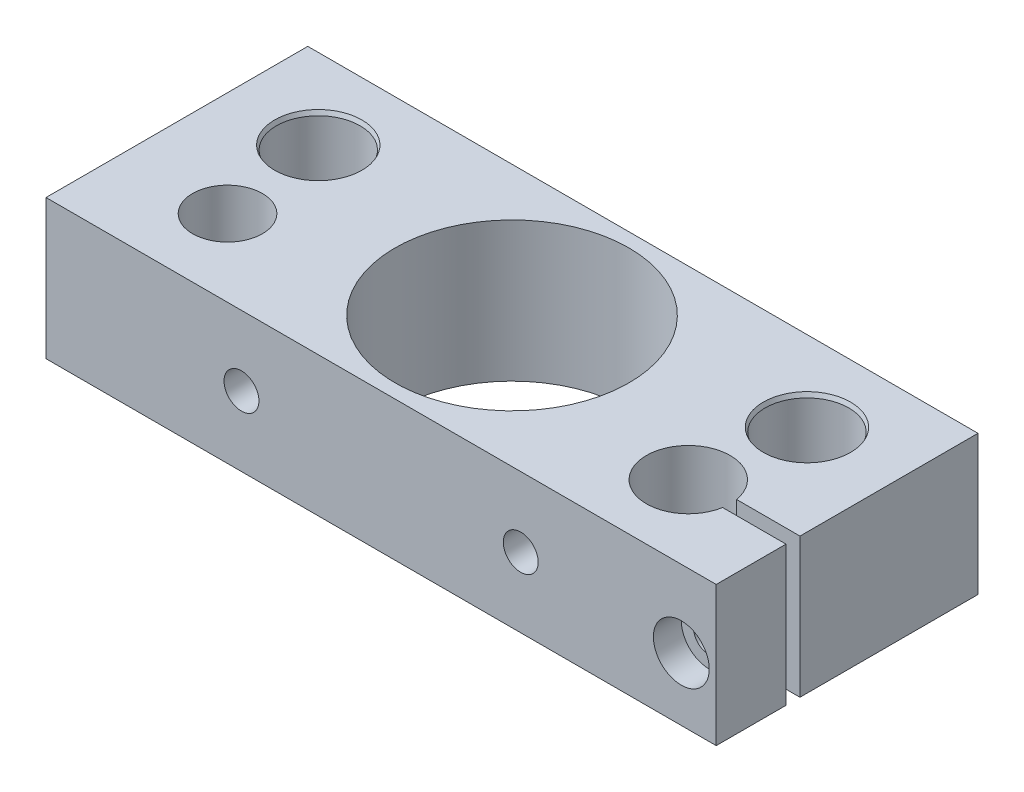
ISO-10303-21;
HEADER;
FILE_DESCRIPTION(('STEP AP214'),'2;1');
FILE_NAME('part.step','',(''),(''),'','','');
FILE_SCHEMA(('AUTOMOTIVE_DESIGN { 1 0 10303 214 1 1 1 1 }'));
ENDSEC;
DATA;
#1=APPLICATION_CONTEXT('core data for automotive mechanical design processes');
#2=APPLICATION_PROTOCOL_DEFINITION('international standard','automotive_design',2000,#1);
#3=PRODUCT_CONTEXT('',#1,'mechanical');
#4=PRODUCT('Part','Part','',(#3));
#5=PRODUCT_RELATED_PRODUCT_CATEGORY('part','',(#4));
#6=PRODUCT_DEFINITION_FORMATION('','',#4);
#7=PRODUCT_DEFINITION_CONTEXT('part definition',#1,'design');
#8=PRODUCT_DEFINITION('design','',#6,#7);
#9=PRODUCT_DEFINITION_SHAPE('','',#8);
#10=(LENGTH_UNIT() NAMED_UNIT(*) SI_UNIT(.MILLI.,.METRE.));
#11=(NAMED_UNIT(*) PLANE_ANGLE_UNIT() SI_UNIT($,.RADIAN.));
#12=(NAMED_UNIT(*) SI_UNIT($,.STERADIAN.) SOLID_ANGLE_UNIT());
#13=UNCERTAINTY_MEASURE_WITH_UNIT(LENGTH_MEASURE(1.E-05),#10,'distance_accuracy_value','');
#14=(GEOMETRIC_REPRESENTATION_CONTEXT(3) GLOBAL_UNCERTAINTY_ASSIGNED_CONTEXT((#13)) GLOBAL_UNIT_ASSIGNED_CONTEXT((#10,
#11,#12)) REPRESENTATION_CONTEXT('',''));
#15=CARTESIAN_POINT('',(0.,0.,0.));
#16=DIRECTION('',(0.,0.,1.));
#17=DIRECTION('',(1.,0.,0.));
#18=AXIS2_PLACEMENT_3D('',#15,#16,#17);
#19=CARTESIAN_POINT('',(96.,20.,0.));
#20=DIRECTION('',(-1.,0.,0.));
#21=DIRECTION('',(0.,0.,1.));
#22=AXIS2_PLACEMENT_3D('',#19,#20,#21);
#23=PLANE('',#22);
#24=DIRECTION('',(0.,0.,-1.));
#25=VECTOR('',#24,1.);
#26=CARTESIAN_POINT('',(96.,0.,0.));
#27=LINE('',#26,#25);
#28=CARTESIAN_POINT('',(96.,0.,0.));
#29=VERTEX_POINT('',#28);
#30=CARTESIAN_POINT('',(96.,0.,-10.));
#31=VERTEX_POINT('',#30);
#32=EDGE_CURVE('E9334',#29,#31,#27,.T.);
#33=ORIENTED_EDGE('',*,*,#32,.T.);
#34=DIRECTION('',(0.,-1.,0.));
#35=VECTOR('',#34,1.);
#36=CARTESIAN_POINT('',(96.,-0.999999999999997,-10.));
#37=LINE('',#36,#35);
#38=CARTESIAN_POINT('',(96.,20.,-10.));
#39=VERTEX_POINT('',#38);
#40=EDGE_CURVE('E9271',#39,#31,#37,.T.);
#41=ORIENTED_EDGE('',*,*,#40,.F.);
#42=DIRECTION('',(0.,0.,-1.));
#43=VECTOR('',#42,1.);
#44=CARTESIAN_POINT('',(96.,20.,0.));
#45=LINE('',#44,#43);
#46=CARTESIAN_POINT('',(96.,20.,0.));
#47=VERTEX_POINT('',#46);
#48=EDGE_CURVE('E9345',#47,#39,#45,.T.);
#49=ORIENTED_EDGE('',*,*,#48,.F.);
#50=DIRECTION('',(0.,-1.,0.));
#51=VECTOR('',#50,1.);
#52=CARTESIAN_POINT('',(96.,20.,0.));
#53=LINE('',#52,#51);
#54=EDGE_CURVE('E9356',#47,#29,#53,.T.);
#55=ORIENTED_EDGE('',*,*,#54,.T.);
#56=EDGE_LOOP('',(#33,#41,#49,#55));
#57=FACE_BOUND('',#56,.T.);
#58=ADVANCED_FACE('F9174',(#57),#23,.F.);
#59=CARTESIAN_POINT('',(0.,20.,0.));
#60=DIRECTION('',(1.,0.,0.));
#61=DIRECTION('',(0.,0.,-1.));
#62=AXIS2_PLACEMENT_3D('',#59,#60,#61);
#63=PLANE('',#62);
#64=DIRECTION('',(0.,0.,1.));
#65=VECTOR('',#64,1.);
#66=CARTESIAN_POINT('',(0.,0.,0.));
#67=LINE('',#66,#65);
#68=CARTESIAN_POINT('',(0.,0.,-37.5));
#69=VERTEX_POINT('',#68);
#70=CARTESIAN_POINT('',(0.,0.,0.));
#71=VERTEX_POINT('',#70);
#72=EDGE_CURVE('E9328',#69,#71,#67,.T.);
#73=ORIENTED_EDGE('',*,*,#72,.T.);
#74=DIRECTION('',(0.,-1.,0.));
#75=VECTOR('',#74,1.);
#76=CARTESIAN_POINT('',(0.,20.,0.));
#77=LINE('',#76,#75);
#78=CARTESIAN_POINT('',(0.,20.,0.));
#79=VERTEX_POINT('',#78);
#80=EDGE_CURVE('E9359',#79,#71,#77,.T.);
#81=ORIENTED_EDGE('',*,*,#80,.F.);
#82=DIRECTION('',(0.,0.,1.));
#83=VECTOR('',#82,1.);
#84=CARTESIAN_POINT('',(0.,20.,0.));
#85=LINE('',#84,#83);
#86=CARTESIAN_POINT('',(0.,20.,-37.5));
#87=VERTEX_POINT('',#86);
#88=EDGE_CURVE('E9339',#87,#79,#85,.T.);
#89=ORIENTED_EDGE('',*,*,#88,.F.);
#90=DIRECTION('',(0.,-1.,0.));
#91=VECTOR('',#90,1.);
#92=CARTESIAN_POINT('',(0.,20.,-37.5));
#93=LINE('',#92,#91);
#94=EDGE_CURVE('E9350',#87,#69,#93,.T.);
#95=ORIENTED_EDGE('',*,*,#94,.T.);
#96=EDGE_LOOP('',(#73,#81,#89,#95));
#97=FACE_BOUND('',#96,.T.);
#98=ADVANCED_FACE('F9176',(#97),#63,.F.);
#99=CARTESIAN_POINT('',(0.,20.,0.));
#100=DIRECTION('',(0.,0.,-1.));
#101=DIRECTION('',(-1.,0.,0.));
#102=AXIS2_PLACEMENT_3D('',#99,#100,#101);
#103=PLANE('',#102);
#104=CARTESIAN_POINT('',(91.,9.,0.));
#105=DIRECTION('',(0.,0.,1.));
#106=DIRECTION('',(1.,0.,0.));
#107=AXIS2_PLACEMENT_3D('',#104,#105,#106);
#108=CIRCLE('',#107,4.);
#109=CARTESIAN_POINT('',(95.,9.,0.));
#110=VERTEX_POINT('',#109);
#111=EDGE_CURVE('E9266',#110,#110,#108,.T.);
#112=ORIENTED_EDGE('',*,*,#111,.F.);
#113=EDGE_LOOP('',(#112));
#114=FACE_BOUND('',#113,.T.);
#115=CARTESIAN_POINT('',(68.,10.,0.));
#116=DIRECTION('',(0.,0.,1.));
#117=DIRECTION('',(1.,0.,0.));
#118=AXIS2_PLACEMENT_3D('',#115,#116,#117);
#119=CIRCLE('',#118,2.49999999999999);
#120=CARTESIAN_POINT('',(70.5,10.,0.));
#121=VERTEX_POINT('',#120);
#122=EDGE_CURVE('E9295',#121,#121,#119,.T.);
#123=ORIENTED_EDGE('',*,*,#122,.F.);
#124=EDGE_LOOP('',(#123));
#125=FACE_BOUND('',#124,.T.);
#126=CARTESIAN_POINT('',(28.,10.,0.));
#127=DIRECTION('',(0.,0.,1.));
#128=DIRECTION('',(1.,0.,0.));
#129=AXIS2_PLACEMENT_3D('',#126,#127,#128);
#130=CIRCLE('',#129,2.49999999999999);
#131=CARTESIAN_POINT('',(30.5,10.,0.));
#132=VERTEX_POINT('',#131);
#133=EDGE_CURVE('E9301',#132,#132,#130,.T.);
#134=ORIENTED_EDGE('',*,*,#133,.F.);
#135=EDGE_LOOP('',(#134));
#136=FACE_BOUND('',#135,.T.);
#137=DIRECTION('',(1.,0.,0.));
#138=VECTOR('',#137,1.);
#139=CARTESIAN_POINT('',(0.,0.,0.));
#140=LINE('',#139,#138);
#141=EDGE_CURVE('E9331',#71,#29,#140,.T.);
#142=ORIENTED_EDGE('',*,*,#141,.T.);
#143=ORIENTED_EDGE('',*,*,#54,.F.);
#144=DIRECTION('',(1.,0.,0.));
#145=VECTOR('',#144,1.);
#146=CARTESIAN_POINT('',(0.,20.,0.));
#147=LINE('',#146,#145);
#148=EDGE_CURVE('E9342',#79,#47,#147,.T.);
#149=ORIENTED_EDGE('',*,*,#148,.F.);
#150=ORIENTED_EDGE('',*,*,#80,.T.);
#151=EDGE_LOOP('',(#142,#143,#149,#150));
#152=FACE_BOUND('',#151,.T.);
#153=ADVANCED_FACE('F9396',(#114,#125,#136,#152),#103,.F.);
#154=CARTESIAN_POINT('',(96.,20.,-12.));
#155=VERTEX_POINT('',#154);
#156=CARTESIAN_POINT('',(96.,20.,-37.5));
#157=VERTEX_POINT('',#156);
#158=EDGE_CURVE('E9344',#155,#157,#45,.T.);
#159=ORIENTED_EDGE('',*,*,#158,.F.);
#160=DIRECTION('',(0.,1.,0.));
#161=VECTOR('',#160,1.);
#162=CARTESIAN_POINT('',(96.,-0.999999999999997,-12.));
#163=LINE('',#162,#161);
#164=CARTESIAN_POINT('',(96.,0.,-12.));
#165=VERTEX_POINT('',#164);
#166=EDGE_CURVE('E9269',#165,#155,#163,.T.);
#167=ORIENTED_EDGE('',*,*,#166,.F.);
#168=CARTESIAN_POINT('',(96.,0.,-37.5));
#169=VERTEX_POINT('',#168);
#170=EDGE_CURVE('E9333',#165,#169,#27,.T.);
#171=ORIENTED_EDGE('',*,*,#170,.T.);
#172=DIRECTION('',(0.,-1.,0.));
#173=VECTOR('',#172,1.);
#174=CARTESIAN_POINT('',(96.,20.,-37.5));
#175=LINE('',#174,#173);
#176=EDGE_CURVE('E9353',#157,#169,#175,.T.);
#177=ORIENTED_EDGE('',*,*,#176,.F.);
#178=EDGE_LOOP('',(#159,#167,#171,#177));
#179=FACE_BOUND('',#178,.T.);
#180=ADVANCED_FACE('F9386',(#179),#23,.F.);
#181=CARTESIAN_POINT('',(0.,20.,-37.5));
#182=DIRECTION('',(0.,0.,1.));
#183=DIRECTION('',(1.,0.,0.));
#184=AXIS2_PLACEMENT_3D('',#181,#182,#183);
#185=PLANE('',#184);
#186=CARTESIAN_POINT('',(68.,10.,-37.5));
#187=DIRECTION('',(0.,0.,1.));
#188=DIRECTION('',(1.,0.,0.));
#189=AXIS2_PLACEMENT_3D('',#186,#187,#188);
#190=CIRCLE('',#189,2.49999999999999);
#191=CARTESIAN_POINT('',(70.5,10.,-37.5));
#192=VERTEX_POINT('',#191);
#193=EDGE_CURVE('E9292',#192,#192,#190,.T.);
#194=ORIENTED_EDGE('',*,*,#193,.T.);
#195=EDGE_LOOP('',(#194));
#196=FACE_BOUND('',#195,.T.);
#197=CARTESIAN_POINT('',(28.,10.,-37.5));
#198=DIRECTION('',(0.,0.,1.));
#199=DIRECTION('',(1.,0.,0.));
#200=AXIS2_PLACEMENT_3D('',#197,#198,#199);
#201=CIRCLE('',#200,2.49999999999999);
#202=CARTESIAN_POINT('',(30.5,10.,-37.5));
#203=VERTEX_POINT('',#202);
#204=EDGE_CURVE('E9298',#203,#203,#201,.T.);
#205=ORIENTED_EDGE('',*,*,#204,.T.);
#206=EDGE_LOOP('',(#205));
#207=FACE_BOUND('',#206,.T.);
#208=DIRECTION('',(-1.,0.,0.));
#209=VECTOR('',#208,1.);
#210=CARTESIAN_POINT('',(0.,0.,-37.5));
#211=LINE('',#210,#209);
#212=EDGE_CURVE('E9337',#169,#69,#211,.T.);
#213=ORIENTED_EDGE('',*,*,#212,.T.);
#214=ORIENTED_EDGE('',*,*,#94,.F.);
#215=DIRECTION('',(-1.,0.,0.));
#216=VECTOR('',#215,1.);
#217=CARTESIAN_POINT('',(0.,20.,-37.5));
#218=LINE('',#217,#216);
#219=EDGE_CURVE('E9348',#157,#87,#218,.T.);
#220=ORIENTED_EDGE('',*,*,#219,.F.);
#221=ORIENTED_EDGE('',*,*,#176,.T.);
#222=EDGE_LOOP('',(#213,#214,#220,#221));
#223=FACE_BOUND('',#222,.T.);
#224=ADVANCED_FACE('F9393',(#196,#207,#223),#185,.F.);
#225=CARTESIAN_POINT('',(0.,20.,-37.5));
#226=DIRECTION('',(0.,-1.,0.));
#227=DIRECTION('',(0.,0.,-1.));
#228=AXIS2_PLACEMENT_3D('',#225,#226,#227);
#229=PLANE('',#228);
#230=CARTESIAN_POINT('',(48.,20.,-18.75));
#231=DIRECTION('',(0.,-1.,0.));
#232=DIRECTION('',(0.,0.,-1.));
#233=AXIS2_PLACEMENT_3D('',#230,#231,#232);
#234=CIRCLE('',#233,16.75);
#235=CARTESIAN_POINT('',(48.,20.,-35.5));
#236=VERTEX_POINT('',#235);
#237=EDGE_CURVE('E9251',#236,#236,#234,.T.);
#238=ORIENTED_EDGE('',*,*,#237,.T.);
#239=EDGE_LOOP('',(#238));
#240=FACE_BOUND('',#239,.T.);
#241=CARTESIAN_POINT('',(15.,20.,-11.));
#242=DIRECTION('',(0.,-1.,0.));
#243=DIRECTION('',(0.,0.,-1.));
#244=AXIS2_PLACEMENT_3D('',#241,#242,#243);
#245=CIRCLE('',#244,5.);
#246=CARTESIAN_POINT('',(15.,20.,-16.));
#247=VERTEX_POINT('',#246);
#248=EDGE_CURVE('E9280',#247,#247,#245,.T.);
#249=ORIENTED_EDGE('',*,*,#248,.T.);
#250=EDGE_LOOP('',(#249));
#251=FACE_BOUND('',#250,.T.);
#252=ORIENTED_EDGE('',*,*,#48,.T.);
#253=DIRECTION('',(-1.,0.,0.));
#254=VECTOR('',#253,1.);
#255=CARTESIAN_POINT('',(0.,20.,-10.));
#256=LINE('',#255,#254);
#257=CARTESIAN_POINT('',(86.9160797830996,20.,-10.));
#258=VERTEX_POINT('',#257);
#259=EDGE_CURVE('E9277',#39,#258,#256,.T.);
#260=ORIENTED_EDGE('',*,*,#259,.T.);
#261=CARTESIAN_POINT('',(81.,20.,-11.));
#262=DIRECTION('',(0.,-1.,0.));
#263=DIRECTION('',(0.,0.,-1.));
#264=AXIS2_PLACEMENT_3D('',#261,#262,#263);
#265=CIRCLE('',#264,5.99999999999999);
#266=CARTESIAN_POINT('',(86.9160797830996,20.,-12.));
#267=VERTEX_POINT('',#266);
#268=EDGE_CURVE('E9286',#258,#267,#265,.T.);
#269=ORIENTED_EDGE('',*,*,#268,.T.);
#270=DIRECTION('',(1.,0.,0.));
#271=VECTOR('',#270,1.);
#272=CARTESIAN_POINT('',(0.,20.,-12.));
#273=LINE('',#272,#271);
#274=EDGE_CURVE('E9197',#267,#155,#273,.T.);
#275=ORIENTED_EDGE('',*,*,#274,.T.);
#276=ORIENTED_EDGE('',*,*,#158,.T.);
#277=ORIENTED_EDGE('',*,*,#219,.T.);
#278=ORIENTED_EDGE('',*,*,#88,.T.);
#279=ORIENTED_EDGE('',*,*,#148,.T.);
#280=EDGE_LOOP('',(#252,#260,#269,#275,#276,#277,#278,#279));
#281=FACE_BOUND('',#280,.T.);
#282=CARTESIAN_POINT('',(83.,20.,-26.));
#283=DIRECTION('',(0.,-1.,0.));
#284=DIRECTION('',(0.,0.,-1.));
#285=AXIS2_PLACEMENT_3D('',#282,#283,#284);
#286=CIRCLE('',#285,6.24999999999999);
#287=CARTESIAN_POINT('',(83.,20.,-32.25));
#288=VERTEX_POINT('',#287);
#289=EDGE_CURVE('E9304',#288,#288,#286,.T.);
#290=ORIENTED_EDGE('',*,*,#289,.T.);
#291=EDGE_LOOP('',(#290));
#292=FACE_BOUND('',#291,.T.);
#293=CARTESIAN_POINT('',(13.,20.,-26.));
#294=DIRECTION('',(0.,-1.,0.));
#295=DIRECTION('',(0.,0.,-1.));
#296=AXIS2_PLACEMENT_3D('',#293,#294,#295);
#297=CIRCLE('',#296,6.25);
#298=CARTESIAN_POINT('',(13.,20.,-32.25));
#299=VERTEX_POINT('',#298);
#300=EDGE_CURVE('E9316',#299,#299,#297,.T.);
#301=ORIENTED_EDGE('',*,*,#300,.T.);
#302=EDGE_LOOP('',(#301));
#303=FACE_BOUND('',#302,.T.);
#304=ADVANCED_FACE('F9368',(#240,#251,#281,#292,#303),#229,.F.);
#305=CARTESIAN_POINT('',(0.,0.,-37.5));
#306=DIRECTION('',(0.,-1.,0.));
#307=DIRECTION('',(0.,0.,-1.));
#308=AXIS2_PLACEMENT_3D('',#305,#306,#307);
#309=PLANE('',#308);
#310=CARTESIAN_POINT('',(48.,0.,-18.75));
#311=DIRECTION('',(0.,-1.,0.));
#312=DIRECTION('',(0.,0.,-1.));
#313=AXIS2_PLACEMENT_3D('',#310,#311,#312);
#314=CIRCLE('',#313,16.75);
#315=CARTESIAN_POINT('',(48.,0.,-35.5));
#316=VERTEX_POINT('',#315);
#317=EDGE_CURVE('E9257',#316,#316,#314,.T.);
#318=ORIENTED_EDGE('',*,*,#317,.F.);
#319=EDGE_LOOP('',(#318));
#320=FACE_BOUND('',#319,.T.);
#321=DIRECTION('',(-1.,0.,0.));
#322=VECTOR('',#321,1.);
#323=CARTESIAN_POINT('',(0.,0.,-10.));
#324=LINE('',#323,#322);
#325=CARTESIAN_POINT('',(86.9160797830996,0.,-10.));
#326=VERTEX_POINT('',#325);
#327=EDGE_CURVE('E9190',#31,#326,#324,.T.);
#328=ORIENTED_EDGE('',*,*,#327,.F.);
#329=ORIENTED_EDGE('',*,*,#32,.F.);
#330=ORIENTED_EDGE('',*,*,#141,.F.);
#331=ORIENTED_EDGE('',*,*,#72,.F.);
#332=ORIENTED_EDGE('',*,*,#212,.F.);
#333=ORIENTED_EDGE('',*,*,#170,.F.);
#334=DIRECTION('',(1.,0.,0.));
#335=VECTOR('',#334,1.);
#336=CARTESIAN_POINT('',(0.,0.,-12.));
#337=LINE('',#336,#335);
#338=CARTESIAN_POINT('',(86.9160797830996,0.,-12.));
#339=VERTEX_POINT('',#338);
#340=EDGE_CURVE('E9273',#339,#165,#337,.T.);
#341=ORIENTED_EDGE('',*,*,#340,.F.);
#342=CARTESIAN_POINT('',(81.,0.,-11.));
#343=DIRECTION('',(0.,-1.,0.));
#344=DIRECTION('',(0.,0.,-1.));
#345=AXIS2_PLACEMENT_3D('',#342,#343,#344);
#346=CIRCLE('',#345,5.99999999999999);
#347=EDGE_CURVE('E9289',#326,#339,#346,.T.);
#348=ORIENTED_EDGE('',*,*,#347,.F.);
#349=EDGE_LOOP('',(#328,#329,#330,#331,#332,#333,#341,#348));
#350=FACE_BOUND('',#349,.T.);
#351=CARTESIAN_POINT('',(15.,0.,-11.));
#352=DIRECTION('',(0.,-1.,0.));
#353=DIRECTION('',(0.,0.,-1.));
#354=AXIS2_PLACEMENT_3D('',#351,#352,#353);
#355=CIRCLE('',#354,4.99999999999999);
#356=CARTESIAN_POINT('',(15.,0.,-16.));
#357=VERTEX_POINT('',#356);
#358=EDGE_CURVE('E9283',#357,#357,#355,.T.);
#359=ORIENTED_EDGE('',*,*,#358,.F.);
#360=EDGE_LOOP('',(#359));
#361=FACE_BOUND('',#360,.T.);
#362=CARTESIAN_POINT('',(83.,0.,-26.));
#363=DIRECTION('',(0.,-1.,0.));
#364=DIRECTION('',(0.,0.,-1.));
#365=AXIS2_PLACEMENT_3D('',#362,#363,#364);
#366=CIRCLE('',#365,6.25000000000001);
#367=CARTESIAN_POINT('',(83.,0.,-32.25));
#368=VERTEX_POINT('',#367);
#369=EDGE_CURVE('E9313',#368,#368,#366,.T.);
#370=ORIENTED_EDGE('',*,*,#369,.F.);
#371=EDGE_LOOP('',(#370));
#372=FACE_BOUND('',#371,.T.);
#373=CARTESIAN_POINT('',(13.,0.,-26.));
#374=DIRECTION('',(0.,-1.,0.));
#375=DIRECTION('',(0.,0.,-1.));
#376=AXIS2_PLACEMENT_3D('',#373,#374,#375);
#377=CIRCLE('',#376,6.25);
#378=CARTESIAN_POINT('',(13.,0.,-32.25));
#379=VERTEX_POINT('',#378);
#380=EDGE_CURVE('E9325',#379,#379,#377,.T.);
#381=ORIENTED_EDGE('',*,*,#380,.F.);
#382=EDGE_LOOP('',(#381));
#383=FACE_BOUND('',#382,.T.);
#384=ADVANCED_FACE('F9378',(#320,#350,#361,#372,#383),#309,.T.);
#385=CARTESIAN_POINT('',(13.,0.,-26.));
#386=DIRECTION('',(0.,-1.,0.));
#387=DIRECTION('',(0.,0.,-1.));
#388=AXIS2_PLACEMENT_3D('',#385,#386,#387);
#389=CONICAL_SURFACE('',#388,6.25,0.392699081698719);
#390=CARTESIAN_POINT('',(13.,0.603553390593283,-26.));
#391=DIRECTION('',(0.,-1.,0.));
#392=DIRECTION('',(0.,0.,-1.));
#393=AXIS2_PLACEMENT_3D('',#390,#391,#392);
#394=CIRCLE('',#393,6.);
#395=CARTESIAN_POINT('',(13.,0.603553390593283,-32.));
#396=VERTEX_POINT('',#395);
#397=EDGE_CURVE('E9322',#396,#396,#394,.T.);
#398=ORIENTED_EDGE('',*,*,#397,.F.);
#399=EDGE_LOOP('',(#398));
#400=FACE_BOUND('',#399,.T.);
#401=ORIENTED_EDGE('',*,*,#380,.T.);
#402=EDGE_LOOP('',(#401));
#403=FACE_BOUND('',#402,.T.);
#404=ADVANCED_FACE('F9421',(#400,#403),#389,.F.);
#405=CARTESIAN_POINT('',(13.,0.,-26.));
#406=DIRECTION('',(0.,-1.,0.));
#407=DIRECTION('',(0.,0.,-1.));
#408=AXIS2_PLACEMENT_3D('',#405,#406,#407);
#409=CYLINDRICAL_SURFACE('',#408,6.);
#410=CARTESIAN_POINT('',(13.,19.3964466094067,-26.));
#411=DIRECTION('',(0.,-1.,0.));
#412=DIRECTION('',(0.,0.,-1.));
#413=AXIS2_PLACEMENT_3D('',#410,#411,#412);
#414=CIRCLE('',#413,6.);
#415=CARTESIAN_POINT('',(13.,19.3964466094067,-32.));
#416=VERTEX_POINT('',#415);
#417=EDGE_CURVE('E9319',#416,#416,#414,.T.);
#418=ORIENTED_EDGE('',*,*,#417,.F.);
#419=EDGE_LOOP('',(#418));
#420=FACE_BOUND('',#419,.T.);
#421=ORIENTED_EDGE('',*,*,#397,.T.);
#422=EDGE_LOOP('',(#421));
#423=FACE_BOUND('',#422,.T.);
#424=ADVANCED_FACE('F9425',(#420,#423),#409,.F.);
#425=CARTESIAN_POINT('',(13.,19.3964466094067,-26.));
#426=DIRECTION('',(0.,1.,0.));
#427=DIRECTION('',(0.,0.,1.));
#428=AXIS2_PLACEMENT_3D('',#425,#426,#427);
#429=CONICAL_SURFACE('',#428,6.,0.392699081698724);
#430=ORIENTED_EDGE('',*,*,#300,.F.);
#431=EDGE_LOOP('',(#430));
#432=FACE_BOUND('',#431,.T.);
#433=ORIENTED_EDGE('',*,*,#417,.T.);
#434=EDGE_LOOP('',(#433));
#435=FACE_BOUND('',#434,.T.);
#436=ADVANCED_FACE('F9429',(#432,#435),#429,.F.);
#437=CARTESIAN_POINT('',(83.,0.,-26.));
#438=DIRECTION('',(0.,-1.,0.));
#439=DIRECTION('',(0.,0.,-1.));
#440=AXIS2_PLACEMENT_3D('',#437,#438,#439);
#441=CONICAL_SURFACE('',#440,6.25000000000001,0.392699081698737);
#442=CARTESIAN_POINT('',(83.,0.603553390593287,-26.));
#443=DIRECTION('',(0.,-1.,0.));
#444=DIRECTION('',(0.,0.,-1.));
#445=AXIS2_PLACEMENT_3D('',#442,#443,#444);
#446=CIRCLE('',#445,5.99999999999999);
#447=CARTESIAN_POINT('',(83.,0.603553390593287,-32.));
#448=VERTEX_POINT('',#447);
#449=EDGE_CURVE('E9310',#448,#448,#446,.T.);
#450=ORIENTED_EDGE('',*,*,#449,.F.);
#451=EDGE_LOOP('',(#450));
#452=FACE_BOUND('',#451,.T.);
#453=ORIENTED_EDGE('',*,*,#369,.T.);
#454=EDGE_LOOP('',(#453));
#455=FACE_BOUND('',#454,.T.);
#456=ADVANCED_FACE('F9433',(#452,#455),#441,.F.);
#457=CARTESIAN_POINT('',(83.,0.,-26.));
#458=DIRECTION('',(0.,-1.,0.));
#459=DIRECTION('',(0.,0.,-1.));
#460=AXIS2_PLACEMENT_3D('',#457,#458,#459);
#461=CYLINDRICAL_SURFACE('',#460,5.99999999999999);
#462=CARTESIAN_POINT('',(83.,19.3964466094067,-26.));
#463=DIRECTION('',(0.,-1.,0.));
#464=DIRECTION('',(0.,0.,-1.));
#465=AXIS2_PLACEMENT_3D('',#462,#463,#464);
#466=CIRCLE('',#465,5.99999999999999);
#467=CARTESIAN_POINT('',(83.,19.3964466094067,-32.));
#468=VERTEX_POINT('',#467);
#469=EDGE_CURVE('E9307',#468,#468,#466,.T.);
#470=ORIENTED_EDGE('',*,*,#469,.F.);
#471=EDGE_LOOP('',(#470));
#472=FACE_BOUND('',#471,.T.);
#473=ORIENTED_EDGE('',*,*,#449,.T.);
#474=EDGE_LOOP('',(#473));
#475=FACE_BOUND('',#474,.T.);
#476=ADVANCED_FACE('F9437',(#472,#475),#461,.F.);
#477=CARTESIAN_POINT('',(83.,19.3964466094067,-26.));
#478=DIRECTION('',(0.,1.,0.));
#479=DIRECTION('',(0.,0.,1.));
#480=AXIS2_PLACEMENT_3D('',#477,#478,#479);
#481=CONICAL_SURFACE('',#480,5.99999999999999,0.392699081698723);
#482=ORIENTED_EDGE('',*,*,#289,.F.);
#483=EDGE_LOOP('',(#482));
#484=FACE_BOUND('',#483,.T.);
#485=ORIENTED_EDGE('',*,*,#469,.T.);
#486=EDGE_LOOP('',(#485));
#487=FACE_BOUND('',#486,.T.);
#488=ADVANCED_FACE('F9441',(#484,#487),#481,.F.);
#489=CARTESIAN_POINT('',(28.,10.,0.));
#490=DIRECTION('',(0.,0.,1.));
#491=DIRECTION('',(1.,0.,0.));
#492=AXIS2_PLACEMENT_3D('',#489,#490,#491);
#493=CYLINDRICAL_SURFACE('',#492,2.49999999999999);
#494=ORIENTED_EDGE('',*,*,#204,.F.);
#495=EDGE_LOOP('',(#494));
#496=FACE_BOUND('',#495,.T.);
#497=ORIENTED_EDGE('',*,*,#133,.T.);
#498=EDGE_LOOP('',(#497));
#499=FACE_BOUND('',#498,.T.);
#500=ADVANCED_FACE('F9445',(#496,#499),#493,.F.);
#501=CARTESIAN_POINT('',(68.,10.,0.));
#502=DIRECTION('',(0.,0.,1.));
#503=DIRECTION('',(1.,0.,0.));
#504=AXIS2_PLACEMENT_3D('',#501,#502,#503);
#505=CYLINDRICAL_SURFACE('',#504,2.49999999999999);
#506=ORIENTED_EDGE('',*,*,#193,.F.);
#507=EDGE_LOOP('',(#506));
#508=FACE_BOUND('',#507,.T.);
#509=ORIENTED_EDGE('',*,*,#122,.T.);
#510=EDGE_LOOP('',(#509));
#511=FACE_BOUND('',#510,.T.);
#512=ADVANCED_FACE('F9449',(#508,#511),#505,.F.);
#513=CARTESIAN_POINT('',(81.,0.,-11.));
#514=DIRECTION('',(0.,-1.,0.));
#515=DIRECTION('',(0.,0.,-1.));
#516=AXIS2_PLACEMENT_3D('',#513,#514,#515);
#517=CYLINDRICAL_SURFACE('',#516,5.99999999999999);
#518=ORIENTED_EDGE('',*,*,#268,.F.);
#519=DIRECTION('',(0.,-1.,0.));
#520=VECTOR('',#519,1.);
#521=CARTESIAN_POINT('',(86.9160797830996,0.,-10.));
#522=LINE('',#521,#520);
#523=EDGE_CURVE('E11',#258,#326,#522,.T.);
#524=ORIENTED_EDGE('',*,*,#523,.T.);
#525=ORIENTED_EDGE('',*,*,#347,.T.);
#526=DIRECTION('',(0.,-1.,0.));
#527=VECTOR('',#526,1.);
#528=CARTESIAN_POINT('',(86.9160797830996,0.,-12.));
#529=LINE('',#528,#527);
#530=EDGE_CURVE('E9183',#339,#267,#529,.F.);
#531=ORIENTED_EDGE('',*,*,#530,.T.);
#532=EDGE_LOOP('',(#518,#524,#525,#531));
#533=FACE_BOUND('',#532,.T.);
#534=ADVANCED_FACE('F9364',(#533),#517,.F.);
#535=CARTESIAN_POINT('',(15.,0.,-11.));
#536=DIRECTION('',(0.,-1.,0.));
#537=DIRECTION('',(0.,0.,-1.));
#538=AXIS2_PLACEMENT_3D('',#535,#536,#537);
#539=CYLINDRICAL_SURFACE('',#538,4.99999999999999);
#540=ORIENTED_EDGE('',*,*,#248,.F.);
#541=EDGE_LOOP('',(#540));
#542=FACE_BOUND('',#541,.T.);
#543=ORIENTED_EDGE('',*,*,#358,.T.);
#544=EDGE_LOOP('',(#543));
#545=FACE_BOUND('',#544,.T.);
#546=ADVANCED_FACE('F9455',(#542,#545),#539,.F.);
#547=CARTESIAN_POINT('',(82.,-0.999999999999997,-12.));
#548=DIRECTION('',(0.,0.,-1.));
#549=DIRECTION('',(0.,1.,0.));
#550=AXIS2_PLACEMENT_3D('',#547,#548,#549);
#551=PLANE('',#550);
#552=CARTESIAN_POINT('',(91.,9.,-12.));
#553=DIRECTION('',(0.,0.,1.));
#554=DIRECTION('',(1.,0.,0.));
#555=AXIS2_PLACEMENT_3D('',#552,#553,#554);
#556=CIRCLE('',#555,1.64999999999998);
#557=CARTESIAN_POINT('',(92.65,9.,-12.));
#558=VERTEX_POINT('',#557);
#559=EDGE_CURVE('E9250',#558,#558,#556,.T.);
#560=ORIENTED_EDGE('',*,*,#559,.F.);
#561=EDGE_LOOP('',(#560));
#562=FACE_BOUND('',#561,.T.);
#563=ORIENTED_EDGE('',*,*,#530,.F.);
#564=ORIENTED_EDGE('',*,*,#340,.T.);
#565=ORIENTED_EDGE('',*,*,#166,.T.);
#566=ORIENTED_EDGE('',*,*,#274,.F.);
#567=EDGE_LOOP('',(#563,#564,#565,#566));
#568=FACE_BOUND('',#567,.T.);
#569=ADVANCED_FACE('F9384',(#562,#568),#551,.F.);
#570=CARTESIAN_POINT('',(82.,-0.999999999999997,-10.));
#571=DIRECTION('',(0.,0.,1.));
#572=DIRECTION('',(0.,-1.,0.));
#573=AXIS2_PLACEMENT_3D('',#570,#571,#572);
#574=PLANE('',#573);
#575=CARTESIAN_POINT('',(91.,9.,-10.));
#576=DIRECTION('',(0.,0.,1.));
#577=DIRECTION('',(0.,-1.,0.));
#578=AXIS2_PLACEMENT_3D('',#575,#576,#577);
#579=CIRCLE('',#578,2.25);
#580=CARTESIAN_POINT('',(91.,6.75,-10.));
#581=VERTEX_POINT('',#580);
#582=EDGE_CURVE('E9178',#581,#581,#579,.T.);
#583=ORIENTED_EDGE('',*,*,#582,.T.);
#584=EDGE_LOOP('',(#583));
#585=FACE_BOUND('',#584,.T.);
#586=ORIENTED_EDGE('',*,*,#40,.T.);
#587=ORIENTED_EDGE('',*,*,#327,.T.);
#588=ORIENTED_EDGE('',*,*,#523,.F.);
#589=ORIENTED_EDGE('',*,*,#259,.F.);
#590=EDGE_LOOP('',(#586,#587,#588,#589));
#591=FACE_BOUND('',#590,.T.);
#592=ADVANCED_FACE('F9373',(#585,#591),#574,.F.);
#593=CARTESIAN_POINT('',(91.,9.,0.));
#594=DIRECTION('',(0.,0.,1.));
#595=DIRECTION('',(1.,0.,0.));
#596=AXIS2_PLACEMENT_3D('',#593,#594,#595);
#597=CYLINDRICAL_SURFACE('',#596,2.25);
#598=CARTESIAN_POINT('',(91.,9.,-4.));
#599=DIRECTION('',(0.,0.,1.));
#600=DIRECTION('',(1.,0.,0.));
#601=AXIS2_PLACEMENT_3D('',#598,#599,#600);
#602=CIRCLE('',#601,2.25);
#603=CARTESIAN_POINT('',(93.25,9.,-4.));
#604=VERTEX_POINT('',#603);
#605=EDGE_CURVE('E9254',#604,#604,#602,.T.);
#606=ORIENTED_EDGE('',*,*,#605,.T.);
#607=EDGE_LOOP('',(#606));
#608=FACE_BOUND('',#607,.T.);
#609=ORIENTED_EDGE('',*,*,#582,.F.);
#610=EDGE_LOOP('',(#609));
#611=FACE_BOUND('',#610,.T.);
#612=ADVANCED_FACE('F9462',(#608,#611),#597,.F.);
#613=CARTESIAN_POINT('',(91.,9.,0.));
#614=DIRECTION('',(0.,0.,1.));
#615=DIRECTION('',(1.,0.,0.));
#616=AXIS2_PLACEMENT_3D('',#613,#614,#615);
#617=CYLINDRICAL_SURFACE('',#616,4.);
#618=CARTESIAN_POINT('',(91.,9.,-4.));
#619=DIRECTION('',(0.,0.,1.));
#620=DIRECTION('',(1.,0.,0.));
#621=AXIS2_PLACEMENT_3D('',#618,#619,#620);
#622=CIRCLE('',#621,4.);
#623=CARTESIAN_POINT('',(95.,9.,-4.));
#624=VERTEX_POINT('',#623);
#625=EDGE_CURVE('E9263',#624,#624,#622,.T.);
#626=ORIENTED_EDGE('',*,*,#625,.F.);
#627=EDGE_LOOP('',(#626));
#628=FACE_BOUND('',#627,.T.);
#629=ORIENTED_EDGE('',*,*,#111,.T.);
#630=EDGE_LOOP('',(#629));
#631=FACE_BOUND('',#630,.T.);
#632=ADVANCED_FACE('F9464',(#628,#631),#617,.F.);
#633=CARTESIAN_POINT('',(93.25,9.,-4.));
#634=DIRECTION('',(0.,0.,-1.));
#635=DIRECTION('',(-1.,0.,0.));
#636=AXIS2_PLACEMENT_3D('',#633,#634,#635);
#637=PLANE('',#636);
#638=ORIENTED_EDGE('',*,*,#605,.F.);
#639=EDGE_LOOP('',(#638));
#640=FACE_BOUND('',#639,.T.);
#641=ORIENTED_EDGE('',*,*,#625,.T.);
#642=EDGE_LOOP('',(#641));
#643=FACE_BOUND('',#642,.T.);
#644=ADVANCED_FACE('F9467',(#640,#643),#637,.F.);
#645=CARTESIAN_POINT('',(91.,9.,-12.));
#646=DIRECTION('',(0.,0.,1.));
#647=DIRECTION('',(1.,0.,0.));
#648=AXIS2_PLACEMENT_3D('',#645,#646,#647);
#649=CYLINDRICAL_SURFACE('',#648,1.64999999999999);
#650=CARTESIAN_POINT('',(91.,9.,-20.1));
#651=DIRECTION('',(0.,0.,1.));
#652=DIRECTION('',(1.,0.,0.));
#653=AXIS2_PLACEMENT_3D('',#650,#651,#652);
#654=CIRCLE('',#653,1.65);
#655=CARTESIAN_POINT('',(92.65,9.,-20.1));
#656=VERTEX_POINT('',#655);
#657=EDGE_CURVE('E9248',#656,#656,#654,.T.);
#658=ORIENTED_EDGE('',*,*,#657,.F.);
#659=EDGE_LOOP('',(#658));
#660=FACE_BOUND('',#659,.T.);
#661=ORIENTED_EDGE('',*,*,#559,.T.);
#662=EDGE_LOOP('',(#661));
#663=FACE_BOUND('',#662,.T.);
#664=ADVANCED_FACE('F9244',(#660,#663),#649,.F.);
#665=CARTESIAN_POINT('',(91.,9.,-20.1));
#666=DIRECTION('',(0.,0.,1.));
#667=DIRECTION('',(1.,0.,0.));
#668=AXIS2_PLACEMENT_3D('',#665,#666,#667);
#669=CONICAL_SURFACE('',#668,1.65,1.02974425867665);
#670=CARTESIAN_POINT('',(91.,9.,-21.0914200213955));
#671=VERTEX_POINT('',#670);
#672=VERTEX_LOOP('',#671);
#673=FACE_BOUND('',#672,.T.);
#674=ORIENTED_EDGE('',*,*,#657,.T.);
#675=EDGE_LOOP('',(#674));
#676=FACE_BOUND('',#675,.T.);
#677=ADVANCED_FACE('F9240',(#673,#676),#669,.F.);
#678=CARTESIAN_POINT('',(48.,25.,-18.75));
#679=DIRECTION('',(0.,-1.,0.));
#680=DIRECTION('',(0.,0.,-1.));
#681=AXIS2_PLACEMENT_3D('',#678,#679,#680);
#682=CYLINDRICAL_SURFACE('',#681,16.75);
#683=ORIENTED_EDGE('',*,*,#317,.T.);
#684=EDGE_LOOP('',(#683));
#685=FACE_BOUND('',#684,.T.);
#686=ORIENTED_EDGE('',*,*,#237,.F.);
#687=EDGE_LOOP('',(#686));
#688=FACE_BOUND('',#687,.T.);
#689=ADVANCED_FACE('F9243',(#685,#688),#682,.F.);
#690=CLOSED_SHELL('',(#58,#98,#153,#180,#224,#304,#384,#404,#424,#436,#456,#476,#488,#500,#512,
#534,#546,#569,#592,#612,#632,#644,#664,#677,#689));
#691=MANIFOLD_SOLID_BREP('B2',#690);
#692=ADVANCED_BREP_SHAPE_REPRESENTATION('',(#18,#691),#14);
#693=SHAPE_DEFINITION_REPRESENTATION(#9,#692);
ENDSEC;
END-ISO-10303-21;
